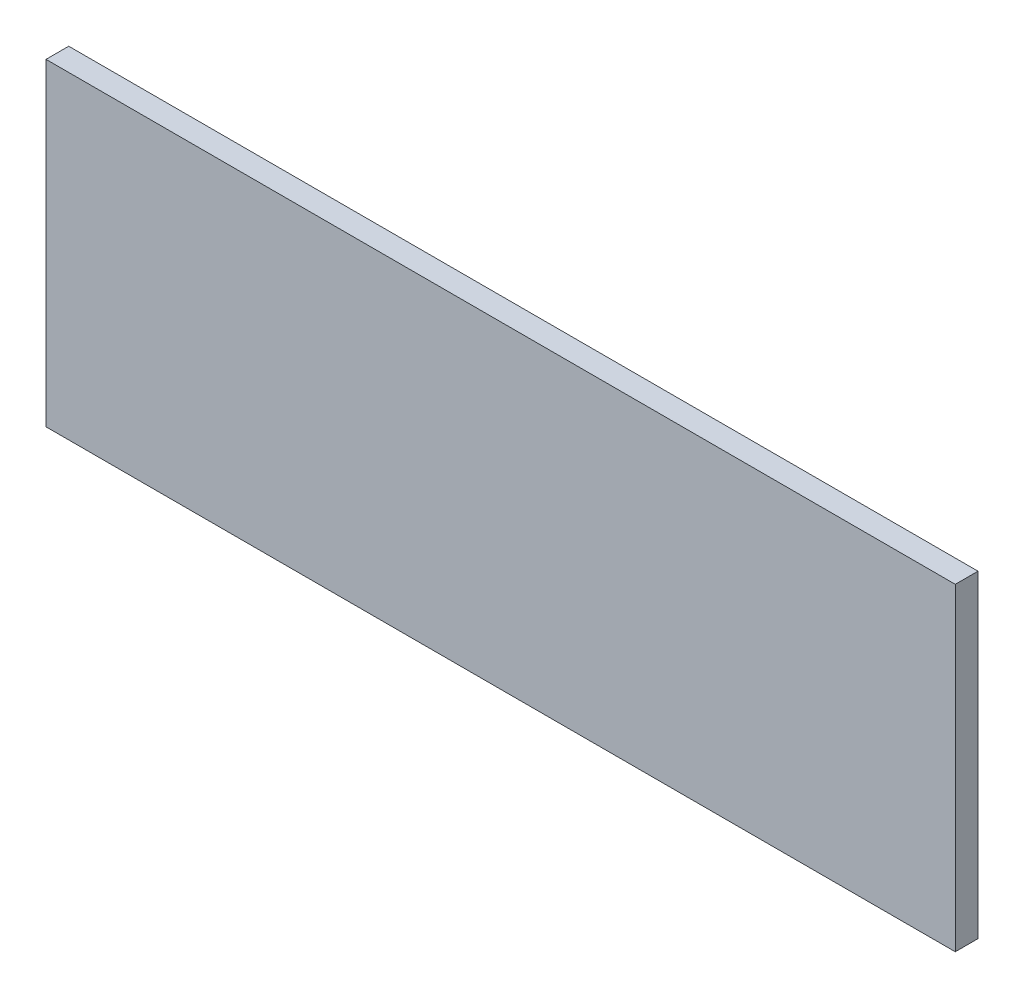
ISO-10303-21;
HEADER;
FILE_DESCRIPTION(('STEP AP214'),'2;1');
FILE_NAME('part.step','',(''),(''),'','','');
FILE_SCHEMA(('AUTOMOTIVE_DESIGN { 1 0 10303 214 1 1 1 1 }'));
ENDSEC;
DATA;
#1=APPLICATION_CONTEXT('core data for automotive mechanical design processes');
#2=APPLICATION_PROTOCOL_DEFINITION('international standard','automotive_design',2000,#1);
#3=PRODUCT_CONTEXT('',#1,'mechanical');
#4=PRODUCT('Part','Part','',(#3));
#5=PRODUCT_RELATED_PRODUCT_CATEGORY('part','',(#4));
#6=PRODUCT_DEFINITION_FORMATION('','',#4);
#7=PRODUCT_DEFINITION_CONTEXT('part definition',#1,'design');
#8=PRODUCT_DEFINITION('design','',#6,#7);
#9=PRODUCT_DEFINITION_SHAPE('','',#8);
#10=(LENGTH_UNIT() NAMED_UNIT(*) SI_UNIT(.MILLI.,.METRE.));
#11=(NAMED_UNIT(*) PLANE_ANGLE_UNIT() SI_UNIT($,.RADIAN.));
#12=(NAMED_UNIT(*) SI_UNIT($,.STERADIAN.) SOLID_ANGLE_UNIT());
#13=UNCERTAINTY_MEASURE_WITH_UNIT(LENGTH_MEASURE(1.E-05),#10,'distance_accuracy_value','');
#14=(GEOMETRIC_REPRESENTATION_CONTEXT(3) GLOBAL_UNCERTAINTY_ASSIGNED_CONTEXT((#13)) GLOBAL_UNIT_ASSIGNED_CONTEXT((#10,
#11,#12)) REPRESENTATION_CONTEXT('',''));
#15=CARTESIAN_POINT('',(0.,0.,0.));
#16=DIRECTION('',(0.,0.,1.));
#17=DIRECTION('',(1.,0.,0.));
#18=AXIS2_PLACEMENT_3D('',#15,#16,#17);
#19=CARTESIAN_POINT('',(0.,0.,6.35));
#20=DIRECTION('',(-1.,0.,0.));
#21=DIRECTION('',(0.,-1.,0.));
#22=AXIS2_PLACEMENT_3D('',#19,#20,#21);
#23=PLANE('',#22);
#24=DIRECTION('',(0.,1.,0.));
#25=VECTOR('',#24,1.);
#26=CARTESIAN_POINT('',(0.,0.,0.));
#27=LINE('',#26,#25);
#28=CARTESIAN_POINT('',(0.,0.,0.));
#29=VERTEX_POINT('',#28);
#30=CARTESIAN_POINT('',(0.,88.9,0.));
#31=VERTEX_POINT('',#30);
#32=EDGE_CURVE('E110',#29,#31,#27,.T.);
#33=ORIENTED_EDGE('',*,*,#32,.F.);
#34=DIRECTION('',(0.,0.,-1.));
#35=VECTOR('',#34,1.);
#36=CARTESIAN_POINT('',(0.,0.,6.35));
#37=LINE('',#36,#35);
#38=CARTESIAN_POINT('',(0.,0.,6.35));
#39=VERTEX_POINT('',#38);
#40=EDGE_CURVE('E11',#39,#29,#37,.T.);
#41=ORIENTED_EDGE('',*,*,#40,.F.);
#42=DIRECTION('',(0.,1.,0.));
#43=VECTOR('',#42,1.);
#44=CARTESIAN_POINT('',(0.,0.,6.35));
#45=LINE('',#44,#43);
#46=CARTESIAN_POINT('',(0.,88.9,6.35));
#47=VERTEX_POINT('',#46);
#48=EDGE_CURVE('E103',#39,#47,#45,.T.);
#49=ORIENTED_EDGE('',*,*,#48,.T.);
#50=DIRECTION('',(0.,0.,-1.));
#51=VECTOR('',#50,1.);
#52=CARTESIAN_POINT('',(0.,88.9,6.35));
#53=LINE('',#52,#51);
#54=EDGE_CURVE('E42',#47,#31,#53,.T.);
#55=ORIENTED_EDGE('',*,*,#54,.T.);
#56=EDGE_LOOP('',(#33,#41,#49,#55));
#57=FACE_BOUND('',#56,.T.);
#58=ADVANCED_FACE('F39',(#57),#23,.T.);
#59=CARTESIAN_POINT('',(0.,0.,6.35));
#60=DIRECTION('',(0.,1.,0.));
#61=DIRECTION('',(0.,0.,1.));
#62=AXIS2_PLACEMENT_3D('',#59,#60,#61);
#63=PLANE('',#62);
#64=DIRECTION('',(1.,0.,0.));
#65=VECTOR('',#64,1.);
#66=CARTESIAN_POINT('',(0.,0.,0.));
#67=LINE('',#66,#65);
#68=CARTESIAN_POINT('',(254.,0.,0.));
#69=VERTEX_POINT('',#68);
#70=EDGE_CURVE('E73',#29,#69,#67,.T.);
#71=ORIENTED_EDGE('',*,*,#70,.T.);
#72=DIRECTION('',(0.,0.,-1.));
#73=VECTOR('',#72,1.);
#74=CARTESIAN_POINT('',(254.,0.,6.35));
#75=LINE('',#74,#73);
#76=CARTESIAN_POINT('',(254.,0.,6.35));
#77=VERTEX_POINT('',#76);
#78=EDGE_CURVE('E49',#77,#69,#75,.T.);
#79=ORIENTED_EDGE('',*,*,#78,.F.);
#80=DIRECTION('',(1.,0.,0.));
#81=VECTOR('',#80,1.);
#82=CARTESIAN_POINT('',(0.,0.,6.35));
#83=LINE('',#82,#81);
#84=EDGE_CURVE('E90',#39,#77,#83,.T.);
#85=ORIENTED_EDGE('',*,*,#84,.F.);
#86=ORIENTED_EDGE('',*,*,#40,.T.);
#87=EDGE_LOOP('',(#71,#79,#85,#86));
#88=FACE_BOUND('',#87,.T.);
#89=ADVANCED_FACE('F126',(#88),#63,.F.);
#90=CARTESIAN_POINT('',(254.,0.,6.35));
#91=DIRECTION('',(-1.,0.,0.));
#92=DIRECTION('',(0.,-1.,0.));
#93=AXIS2_PLACEMENT_3D('',#90,#91,#92);
#94=PLANE('',#93);
#95=DIRECTION('',(0.,1.,0.));
#96=VECTOR('',#95,1.);
#97=CARTESIAN_POINT('',(254.,0.,0.));
#98=LINE('',#97,#96);
#99=CARTESIAN_POINT('',(254.,88.9,0.));
#100=VERTEX_POINT('',#99);
#101=EDGE_CURVE('E98',#69,#100,#98,.T.);
#102=ORIENTED_EDGE('',*,*,#101,.T.);
#103=DIRECTION('',(0.,0.,-1.));
#104=VECTOR('',#103,1.);
#105=CARTESIAN_POINT('',(254.,88.9,6.35));
#106=LINE('',#105,#104);
#107=CARTESIAN_POINT('',(254.,88.9,6.35));
#108=VERTEX_POINT('',#107);
#109=EDGE_CURVE('E95',#108,#100,#106,.T.);
#110=ORIENTED_EDGE('',*,*,#109,.F.);
#111=DIRECTION('',(0.,1.,0.));
#112=VECTOR('',#111,1.);
#113=CARTESIAN_POINT('',(254.,0.,6.35));
#114=LINE('',#113,#112);
#115=EDGE_CURVE('E85',#77,#108,#114,.T.);
#116=ORIENTED_EDGE('',*,*,#115,.F.);
#117=ORIENTED_EDGE('',*,*,#78,.T.);
#118=EDGE_LOOP('',(#102,#110,#116,#117));
#119=FACE_BOUND('',#118,.T.);
#120=ADVANCED_FACE('F96',(#119),#94,.F.);
#121=CARTESIAN_POINT('',(0.,88.9,6.35));
#122=DIRECTION('',(0.,1.,0.));
#123=DIRECTION('',(0.,0.,1.));
#124=AXIS2_PLACEMENT_3D('',#121,#122,#123);
#125=PLANE('',#124);
#126=DIRECTION('',(1.,0.,0.));
#127=VECTOR('',#126,1.);
#128=CARTESIAN_POINT('',(0.,88.9,0.));
#129=LINE('',#128,#127);
#130=EDGE_CURVE('E114',#31,#100,#129,.T.);
#131=ORIENTED_EDGE('',*,*,#130,.F.);
#132=ORIENTED_EDGE('',*,*,#54,.F.);
#133=DIRECTION('',(1.,0.,0.));
#134=VECTOR('',#133,1.);
#135=CARTESIAN_POINT('',(0.,88.9,6.35));
#136=LINE('',#135,#134);
#137=EDGE_CURVE('E89',#47,#108,#136,.T.);
#138=ORIENTED_EDGE('',*,*,#137,.T.);
#139=ORIENTED_EDGE('',*,*,#109,.T.);
#140=EDGE_LOOP('',(#131,#132,#138,#139));
#141=FACE_BOUND('',#140,.T.);
#142=ADVANCED_FACE('F101',(#141),#125,.T.);
#143=CARTESIAN_POINT('',(0.,0.,6.35));
#144=DIRECTION('',(0.,0.,-1.));
#145=DIRECTION('',(-1.,0.,0.));
#146=AXIS2_PLACEMENT_3D('',#143,#144,#145);
#147=PLANE('',#146);
#148=ORIENTED_EDGE('',*,*,#48,.F.);
#149=ORIENTED_EDGE('',*,*,#84,.T.);
#150=ORIENTED_EDGE('',*,*,#115,.T.);
#151=ORIENTED_EDGE('',*,*,#137,.F.);
#152=EDGE_LOOP('',(#148,#149,#150,#151));
#153=FACE_BOUND('',#152,.T.);
#154=ADVANCED_FACE('F88',(#153),#147,.F.);
#155=CARTESIAN_POINT('',(0.,0.,0.));
#156=DIRECTION('',(0.,0.,-1.));
#157=DIRECTION('',(-1.,0.,0.));
#158=AXIS2_PLACEMENT_3D('',#155,#156,#157);
#159=PLANE('',#158);
#160=ORIENTED_EDGE('',*,*,#32,.T.);
#161=ORIENTED_EDGE('',*,*,#130,.T.);
#162=ORIENTED_EDGE('',*,*,#101,.F.);
#163=ORIENTED_EDGE('',*,*,#70,.F.);
#164=EDGE_LOOP('',(#160,#161,#162,#163));
#165=FACE_BOUND('',#164,.T.);
#166=ADVANCED_FACE('F123',(#165),#159,.T.);
#167=CLOSED_SHELL('',(#58,#89,#120,#142,#154,#166));
#168=MANIFOLD_SOLID_BREP('B2',#167);
#169=ADVANCED_BREP_SHAPE_REPRESENTATION('',(#18,#168),#14);
#170=SHAPE_DEFINITION_REPRESENTATION(#9,#169);
ENDSEC;
END-ISO-10303-21;
